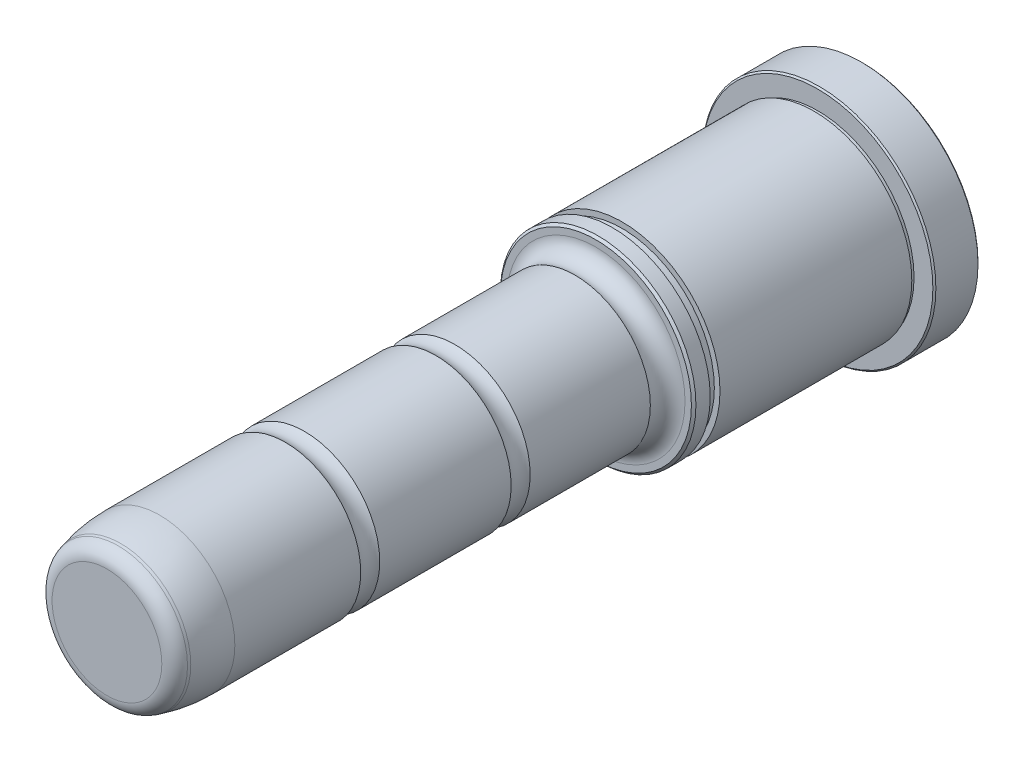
ISO-10303-21;
HEADER;
FILE_DESCRIPTION(('STEP AP214'),'2;1');
FILE_NAME('part.step','',(''),(''),'','','');
FILE_SCHEMA(('AUTOMOTIVE_DESIGN { 1 0 10303 214 1 1 1 1 }'));
ENDSEC;
DATA;
#1=APPLICATION_CONTEXT('core data for automotive mechanical design processes');
#2=APPLICATION_PROTOCOL_DEFINITION('international standard','automotive_design',2000,#1);
#3=PRODUCT_CONTEXT('',#1,'mechanical');
#4=PRODUCT('Part','Part','',(#3));
#5=PRODUCT_RELATED_PRODUCT_CATEGORY('part','',(#4));
#6=PRODUCT_DEFINITION_FORMATION('','',#4);
#7=PRODUCT_DEFINITION_CONTEXT('part definition',#1,'design');
#8=PRODUCT_DEFINITION('design','',#6,#7);
#9=PRODUCT_DEFINITION_SHAPE('','',#8);
#10=(LENGTH_UNIT() NAMED_UNIT(*) SI_UNIT(.MILLI.,.METRE.));
#11=(NAMED_UNIT(*) PLANE_ANGLE_UNIT() SI_UNIT($,.RADIAN.));
#12=(NAMED_UNIT(*) SI_UNIT($,.STERADIAN.) SOLID_ANGLE_UNIT());
#13=UNCERTAINTY_MEASURE_WITH_UNIT(LENGTH_MEASURE(1.E-05),#10,'distance_accuracy_value','');
#14=(GEOMETRIC_REPRESENTATION_CONTEXT(3) GLOBAL_UNCERTAINTY_ASSIGNED_CONTEXT((#13)) GLOBAL_UNIT_ASSIGNED_CONTEXT((#10,
#11,#12)) REPRESENTATION_CONTEXT('',''));
#15=CARTESIAN_POINT('',(0.,0.,0.));
#16=DIRECTION('',(0.,0.,1.));
#17=DIRECTION('',(1.,0.,0.));
#18=AXIS2_PLACEMENT_3D('',#15,#16,#17);
#19=CARTESIAN_POINT('',(0.,0.,0.250000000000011));
#20=DIRECTION('',(0.,0.,1.));
#21=DIRECTION('',(1.,0.,0.));
#22=AXIS2_PLACEMENT_3D('',#19,#20,#21);
#23=CYLINDRICAL_SURFACE('',#22,10.);
#24=CARTESIAN_POINT('',(0.,0.,38.5099342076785));
#25=DIRECTION('',(0.,0.,1.));
#26=DIRECTION('',(1.,0.,0.));
#27=AXIS2_PLACEMENT_3D('',#24,#25,#26);
#28=CIRCLE('',#27,10.);
#29=CARTESIAN_POINT('',(10.,0.,38.5099342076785));
#30=VERTEX_POINT('',#29);
#31=EDGE_CURVE('E10',#30,#30,#28,.T.);
#32=ORIENTED_EDGE('',*,*,#31,.T.);
#33=EDGE_LOOP('',(#32));
#34=FACE_BOUND('',#33,.T.);
#35=CARTESIAN_POINT('',(0.,0.,54.4850889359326));
#36=DIRECTION('',(0.,0.,1.));
#37=DIRECTION('',(1.,0.,0.));
#38=AXIS2_PLACEMENT_3D('',#35,#36,#37);
#39=CIRCLE('',#38,10.);
#40=CARTESIAN_POINT('',(10.,0.,54.4850889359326));
#41=VERTEX_POINT('',#40);
#42=EDGE_CURVE('E105',#41,#41,#39,.T.);
#43=ORIENTED_EDGE('',*,*,#42,.F.);
#44=EDGE_LOOP('',(#43));
#45=FACE_BOUND('',#44,.T.);
#46=ADVANCED_FACE('F34',(#34,#45),#23,.T.);
#47=CARTESIAN_POINT('',(0.,0.,0.250000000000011));
#48=DIRECTION('',(0.,0.,1.));
#49=DIRECTION('',(1.,0.,0.));
#50=AXIS2_PLACEMENT_3D('',#47,#48,#49);
#51=CYLINDRICAL_SURFACE('',#50,13.);
#52=CARTESIAN_POINT('',(0.,0.,35.45));
#53=DIRECTION('',(0.,0.,1.));
#54=DIRECTION('',(1.,0.,0.));
#55=AXIS2_PLACEMENT_3D('',#52,#53,#54);
#56=CIRCLE('',#55,13.);
#57=CARTESIAN_POINT('',(13.,0.,35.45));
#58=VERTEX_POINT('',#57);
#59=EDGE_CURVE('E78',#58,#58,#56,.T.);
#60=ORIENTED_EDGE('',*,*,#59,.F.);
#61=EDGE_LOOP('',(#60));
#62=FACE_BOUND('',#61,.T.);
#63=CARTESIAN_POINT('',(0.,0.,33.55));
#64=DIRECTION('',(0.,0.,1.));
#65=DIRECTION('',(1.,0.,0.));
#66=AXIS2_PLACEMENT_3D('',#63,#64,#65);
#67=CIRCLE('',#66,13.);
#68=CARTESIAN_POINT('',(13.,0.,33.55));
#69=VERTEX_POINT('',#68);
#70=EDGE_CURVE('E102',#69,#69,#67,.T.);
#71=ORIENTED_EDGE('',*,*,#70,.T.);
#72=EDGE_LOOP('',(#71));
#73=FACE_BOUND('',#72,.T.);
#74=ADVANCED_FACE('F130',(#62,#73),#51,.T.);
#75=CARTESIAN_POINT('',(0.,0.,37.75));
#76=DIRECTION('',(0.,0.,1.));
#77=DIRECTION('',(1.,0.,0.));
#78=AXIS2_PLACEMENT_3D('',#75,#76,#77);
#79=TOROIDAL_SURFACE('',#78,11.85,2.);
#80=ORIENTED_EDGE('',*,*,#31,.F.);
#81=EDGE_LOOP('',(#80));
#82=FACE_BOUND('',#81,.T.);
#83=CARTESIAN_POINT('',(0.,0.,35.75));
#84=DIRECTION('',(0.,0.,1.));
#85=DIRECTION('',(1.,0.,0.));
#86=AXIS2_PLACEMENT_3D('',#83,#84,#85);
#87=CIRCLE('',#86,11.85);
#88=CARTESIAN_POINT('',(11.85,0.,35.75));
#89=VERTEX_POINT('',#88);
#90=EDGE_CURVE('E84',#89,#89,#87,.T.);
#91=ORIENTED_EDGE('',*,*,#90,.T.);
#92=EDGE_LOOP('',(#91));
#93=FACE_BOUND('',#92,.T.);
#94=ADVANCED_FACE('F36',(#82,#93),#79,.F.);
#95=CARTESIAN_POINT('',(0.,0.,35.45));
#96=DIRECTION('',(0.,0.,-1.));
#97=DIRECTION('',(-1.,0.,0.));
#98=AXIS2_PLACEMENT_3D('',#95,#96,#97);
#99=CONICAL_SURFACE('',#98,13.,0.785398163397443);
#100=CARTESIAN_POINT('',(0.,0.,35.75));
#101=DIRECTION('',(0.,0.,1.));
#102=DIRECTION('',(1.,0.,0.));
#103=AXIS2_PLACEMENT_3D('',#100,#101,#102);
#104=CIRCLE('',#103,12.7);
#105=CARTESIAN_POINT('',(12.7,0.,35.75));
#106=VERTEX_POINT('',#105);
#107=EDGE_CURVE('E81',#106,#106,#104,.T.);
#108=ORIENTED_EDGE('',*,*,#107,.F.);
#109=EDGE_LOOP('',(#108));
#110=FACE_BOUND('',#109,.T.);
#111=ORIENTED_EDGE('',*,*,#59,.T.);
#112=EDGE_LOOP('',(#111));
#113=FACE_BOUND('',#112,.T.);
#114=ADVANCED_FACE('F164',(#110,#113),#99,.T.);
#115=CARTESIAN_POINT('',(0.,12.7,35.75));
#116=DIRECTION('',(0.,0.,-1.));
#117=DIRECTION('',(-1.,0.,0.));
#118=AXIS2_PLACEMENT_3D('',#115,#116,#117);
#119=PLANE('',#118);
#120=ORIENTED_EDGE('',*,*,#90,.F.);
#121=EDGE_LOOP('',(#120));
#122=FACE_BOUND('',#121,.T.);
#123=ORIENTED_EDGE('',*,*,#107,.T.);
#124=EDGE_LOOP('',(#123));
#125=FACE_BOUND('',#124,.T.);
#126=ADVANCED_FACE('F161',(#122,#125),#119,.F.);
#127=CARTESIAN_POINT('',(0.,13.,33.55));
#128=DIRECTION('',(0.,0.,-1.));
#129=DIRECTION('',(-1.,0.,0.));
#130=AXIS2_PLACEMENT_3D('',#127,#128,#129);
#131=PLANE('',#130);
#132=CARTESIAN_POINT('',(0.,0.,33.55));
#133=DIRECTION('',(0.,0.,1.));
#134=DIRECTION('',(1.,0.,0.));
#135=AXIS2_PLACEMENT_3D('',#132,#133,#134);
#136=CIRCLE('',#135,12.25);
#137=CARTESIAN_POINT('',(12.25,0.,33.55));
#138=VERTEX_POINT('',#137);
#139=EDGE_CURVE('E93',#138,#138,#136,.T.);
#140=ORIENTED_EDGE('',*,*,#139,.T.);
#141=EDGE_LOOP('',(#140));
#142=FACE_BOUND('',#141,.T.);
#143=ORIENTED_EDGE('',*,*,#70,.F.);
#144=EDGE_LOOP('',(#143));
#145=FACE_BOUND('',#144,.T.);
#146=ADVANCED_FACE('F159',(#142,#145),#131,.T.);
#147=CARTESIAN_POINT('',(0.,0.,100.75));
#148=DIRECTION('',(0.,0.,1.));
#149=DIRECTION('',(1.,0.,0.));
#150=AXIS2_PLACEMENT_3D('',#147,#148,#149);
#151=CYLINDRICAL_SURFACE('',#150,12.25);
#152=CARTESIAN_POINT('',(0.,0.,32.25));
#153=DIRECTION('',(0.,0.,1.));
#154=DIRECTION('',(1.,0.,0.));
#155=AXIS2_PLACEMENT_3D('',#152,#153,#154);
#156=CIRCLE('',#155,12.25);
#157=CARTESIAN_POINT('',(12.25,0.,32.25));
#158=VERTEX_POINT('',#157);
#159=EDGE_CURVE('E96',#158,#158,#156,.T.);
#160=ORIENTED_EDGE('',*,*,#159,.T.);
#161=EDGE_LOOP('',(#160));
#162=FACE_BOUND('',#161,.T.);
#163=ORIENTED_EDGE('',*,*,#139,.F.);
#164=EDGE_LOOP('',(#163));
#165=FACE_BOUND('',#164,.T.);
#166=ADVANCED_FACE('F237',(#162,#165),#151,.T.);
#167=CARTESIAN_POINT('',(0.,12.25,32.25));
#168=DIRECTION('',(0.,0.,1.));
#169=DIRECTION('',(1.,0.,0.));
#170=AXIS2_PLACEMENT_3D('',#167,#168,#169);
#171=PLANE('',#170);
#172=CARTESIAN_POINT('',(0.,0.,32.25));
#173=DIRECTION('',(0.,0.,1.));
#174=DIRECTION('',(1.,0.,0.));
#175=AXIS2_PLACEMENT_3D('',#172,#173,#174);
#176=CIRCLE('',#175,13.);
#177=CARTESIAN_POINT('',(13.,0.,32.25));
#178=VERTEX_POINT('',#177);
#179=EDGE_CURVE('E99',#178,#178,#176,.T.);
#180=ORIENTED_EDGE('',*,*,#179,.T.);
#181=EDGE_LOOP('',(#180));
#182=FACE_BOUND('',#181,.T.);
#183=ORIENTED_EDGE('',*,*,#159,.F.);
#184=EDGE_LOOP('',(#183));
#185=FACE_BOUND('',#184,.T.);
#186=ADVANCED_FACE('F194',(#182,#185),#171,.T.);
#187=CARTESIAN_POINT('',(0.,0.,0.250000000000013));
#188=DIRECTION('',(0.,0.,1.));
#189=DIRECTION('',(1.,0.,0.));
#190=AXIS2_PLACEMENT_3D('',#187,#188,#189);
#191=PLANE('',#190);
#192=CARTESIAN_POINT('',(0.,0.,0.250000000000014));
#193=DIRECTION('',(0.,0.,1.));
#194=DIRECTION('',(1.,0.,0.));
#195=AXIS2_PLACEMENT_3D('',#192,#193,#194);
#196=CIRCLE('',#195,15.3);
#197=CARTESIAN_POINT('',(15.3,0.,0.250000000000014));
#198=VERTEX_POINT('',#197);
#199=EDGE_CURVE('E57',#198,#198,#196,.T.);
#200=ORIENTED_EDGE('',*,*,#199,.F.);
#201=EDGE_LOOP('',(#200));
#202=FACE_BOUND('',#201,.T.);
#203=ADVANCED_FACE('F191',(#202),#191,.F.);
#204=CARTESIAN_POINT('',(0.,0.,0.250000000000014));
#205=DIRECTION('',(0.,0.,1.));
#206=DIRECTION('',(1.,0.,0.));
#207=AXIS2_PLACEMENT_3D('',#204,#205,#206);
#208=CONICAL_SURFACE('',#207,15.3,0.785398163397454);
#209=CARTESIAN_POINT('',(0.,0.,0.450000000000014));
#210=DIRECTION('',(0.,0.,1.));
#211=DIRECTION('',(1.,0.,0.));
#212=AXIS2_PLACEMENT_3D('',#209,#210,#211);
#213=CIRCLE('',#212,15.5);
#214=CARTESIAN_POINT('',(15.5,0.,0.450000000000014));
#215=VERTEX_POINT('',#214);
#216=EDGE_CURVE('E60',#215,#215,#213,.T.);
#217=ORIENTED_EDGE('',*,*,#216,.F.);
#218=EDGE_LOOP('',(#217));
#219=FACE_BOUND('',#218,.T.);
#220=ORIENTED_EDGE('',*,*,#199,.T.);
#221=EDGE_LOOP('',(#220));
#222=FACE_BOUND('',#221,.T.);
#223=ADVANCED_FACE('F187',(#219,#222),#208,.T.);
#224=CARTESIAN_POINT('',(0.,0.,0.250000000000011));
#225=DIRECTION('',(0.,0.,1.));
#226=DIRECTION('',(1.,0.,0.));
#227=AXIS2_PLACEMENT_3D('',#224,#225,#226);
#228=CYLINDRICAL_SURFACE('',#227,15.5);
#229=CARTESIAN_POINT('',(0.,0.,6.05000000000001));
#230=DIRECTION('',(0.,0.,1.));
#231=DIRECTION('',(1.,0.,0.));
#232=AXIS2_PLACEMENT_3D('',#229,#230,#231);
#233=CIRCLE('',#232,15.5);
#234=CARTESIAN_POINT('',(15.5,0.,6.05000000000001));
#235=VERTEX_POINT('',#234);
#236=EDGE_CURVE('E63',#235,#235,#233,.T.);
#237=ORIENTED_EDGE('',*,*,#236,.F.);
#238=EDGE_LOOP('',(#237));
#239=FACE_BOUND('',#238,.T.);
#240=ORIENTED_EDGE('',*,*,#216,.T.);
#241=EDGE_LOOP('',(#240));
#242=FACE_BOUND('',#241,.T.);
#243=ADVANCED_FACE('F183',(#239,#242),#228,.T.);
#244=CARTESIAN_POINT('',(0.,0.,6.05000000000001));
#245=DIRECTION('',(0.,0.,-1.));
#246=DIRECTION('',(-1.,0.,0.));
#247=AXIS2_PLACEMENT_3D('',#244,#245,#246);
#248=CONICAL_SURFACE('',#247,15.5,0.785398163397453);
#249=CARTESIAN_POINT('',(0.,0.,6.25000000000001));
#250=DIRECTION('',(0.,0.,1.));
#251=DIRECTION('',(1.,0.,0.));
#252=AXIS2_PLACEMENT_3D('',#249,#250,#251);
#253=CIRCLE('',#252,15.3);
#254=CARTESIAN_POINT('',(15.3,0.,6.25000000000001));
#255=VERTEX_POINT('',#254);
#256=EDGE_CURVE('E66',#255,#255,#253,.T.);
#257=ORIENTED_EDGE('',*,*,#256,.F.);
#258=EDGE_LOOP('',(#257));
#259=FACE_BOUND('',#258,.T.);
#260=ORIENTED_EDGE('',*,*,#236,.T.);
#261=EDGE_LOOP('',(#260));
#262=FACE_BOUND('',#261,.T.);
#263=ADVANCED_FACE('F179',(#259,#262),#248,.T.);
#264=CARTESIAN_POINT('',(0.,15.3,6.25000000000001));
#265=DIRECTION('',(0.,0.,-1.));
#266=DIRECTION('',(-1.,0.,0.));
#267=AXIS2_PLACEMENT_3D('',#264,#265,#266);
#268=PLANE('',#267);
#269=CARTESIAN_POINT('',(0.,0.,6.25000000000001));
#270=DIRECTION('',(0.,0.,1.));
#271=DIRECTION('',(1.,0.,0.));
#272=AXIS2_PLACEMENT_3D('',#269,#270,#271);
#273=CIRCLE('',#272,12.8);
#274=CARTESIAN_POINT('',(12.8,0.,6.25000000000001));
#275=VERTEX_POINT('',#274);
#276=EDGE_CURVE('E69',#275,#275,#273,.T.);
#277=ORIENTED_EDGE('',*,*,#276,.F.);
#278=EDGE_LOOP('',(#277));
#279=FACE_BOUND('',#278,.T.);
#280=ORIENTED_EDGE('',*,*,#256,.T.);
#281=EDGE_LOOP('',(#280));
#282=FACE_BOUND('',#281,.T.);
#283=ADVANCED_FACE('F175',(#279,#282),#268,.F.);
#284=CARTESIAN_POINT('',(0.,0.,0.250000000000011));
#285=DIRECTION('',(0.,0.,1.));
#286=DIRECTION('',(1.,0.,0.));
#287=AXIS2_PLACEMENT_3D('',#284,#285,#286);
#288=CYLINDRICAL_SURFACE('',#287,12.8);
#289=CARTESIAN_POINT('',(0.,0.,6.75000000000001));
#290=DIRECTION('',(0.,0.,1.));
#291=DIRECTION('',(1.,0.,0.));
#292=AXIS2_PLACEMENT_3D('',#289,#290,#291);
#293=CIRCLE('',#292,12.8);
#294=CARTESIAN_POINT('',(12.8,0.,6.75000000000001));
#295=VERTEX_POINT('',#294);
#296=EDGE_CURVE('E72',#295,#295,#293,.T.);
#297=ORIENTED_EDGE('',*,*,#296,.F.);
#298=EDGE_LOOP('',(#297));
#299=FACE_BOUND('',#298,.T.);
#300=ORIENTED_EDGE('',*,*,#276,.T.);
#301=EDGE_LOOP('',(#300));
#302=FACE_BOUND('',#301,.T.);
#303=ADVANCED_FACE('F171',(#299,#302),#288,.T.);
#304=CARTESIAN_POINT('',(0.,12.8,6.75000000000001));
#305=DIRECTION('',(0.,0.,1.));
#306=DIRECTION('',(1.,0.,0.));
#307=AXIS2_PLACEMENT_3D('',#304,#305,#306);
#308=PLANE('',#307);
#309=CARTESIAN_POINT('',(0.,0.,6.75000000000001));
#310=DIRECTION('',(0.,0.,1.));
#311=DIRECTION('',(1.,0.,0.));
#312=AXIS2_PLACEMENT_3D('',#309,#310,#311);
#313=CIRCLE('',#312,13.);
#314=CARTESIAN_POINT('',(13.,0.,6.75000000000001));
#315=VERTEX_POINT('',#314);
#316=EDGE_CURVE('E75',#315,#315,#313,.T.);
#317=ORIENTED_EDGE('',*,*,#316,.F.);
#318=EDGE_LOOP('',(#317));
#319=FACE_BOUND('',#318,.T.);
#320=ORIENTED_EDGE('',*,*,#296,.T.);
#321=EDGE_LOOP('',(#320));
#322=FACE_BOUND('',#321,.T.);
#323=ADVANCED_FACE('F127',(#319,#322),#308,.F.);
#324=ORIENTED_EDGE('',*,*,#316,.T.);
#325=EDGE_LOOP('',(#324));
#326=FACE_BOUND('',#325,.T.);
#327=ORIENTED_EDGE('',*,*,#179,.F.);
#328=EDGE_LOOP('',(#327));
#329=FACE_BOUND('',#328,.T.);
#330=ADVANCED_FACE('F117',(#326,#329),#51,.T.);
#331=CARTESIAN_POINT('',(0.,0.,55.75));
#332=DIRECTION('',(0.,0.,1.));
#333=DIRECTION('',(1.,0.,0.));
#334=AXIS2_PLACEMENT_3D('',#331,#332,#333);
#335=TOROIDAL_SURFACE('',#334,11.8000000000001,2.20000000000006);
#336=ORIENTED_EDGE('',*,*,#42,.T.);
#337=EDGE_LOOP('',(#336));
#338=FACE_BOUND('',#337,.T.);
#339=CARTESIAN_POINT('',(0.,0.,57.0149110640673));
#340=DIRECTION('',(0.,0.,1.));
#341=DIRECTION('',(1.,0.,0.));
#342=AXIS2_PLACEMENT_3D('',#339,#340,#341);
#343=CIRCLE('',#342,10.);
#344=CARTESIAN_POINT('',(10.,0.,57.0149110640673));
#345=VERTEX_POINT('',#344);
#346=EDGE_CURVE('E108',#345,#345,#343,.T.);
#347=ORIENTED_EDGE('',*,*,#346,.F.);
#348=EDGE_LOOP('',(#347));
#349=FACE_BOUND('',#348,.T.);
#350=ADVANCED_FACE('F114',(#338,#349),#335,.F.);
#351=CARTESIAN_POINT('',(0.,7.29522528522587,100.75));
#352=DIRECTION('',(0.,0.,-1.));
#353=DIRECTION('',(-1.,0.,0.));
#354=AXIS2_PLACEMENT_3D('',#351,#352,#353);
#355=PLANE('',#354);
#356=CARTESIAN_POINT('',(0.,0.,100.75));
#357=DIRECTION('',(0.,0.,1.));
#358=DIRECTION('',(1.,0.,0.));
#359=AXIS2_PLACEMENT_3D('',#356,#357,#358);
#360=CIRCLE('',#359,7.29522528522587);
#361=CARTESIAN_POINT('',(7.29522528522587,0.,100.75));
#362=VERTEX_POINT('',#361);
#363=EDGE_CURVE('E54',#362,#362,#360,.T.);
#364=ORIENTED_EDGE('',*,*,#363,.T.);
#365=EDGE_LOOP('',(#364));
#366=FACE_BOUND('',#365,.T.);
#367=ADVANCED_FACE('F116',(#366),#355,.F.);
#368=CARTESIAN_POINT('',(0.,0.,98.75));
#369=DIRECTION('',(0.,0.,1.));
#370=DIRECTION('',(1.,0.,0.));
#371=AXIS2_PLACEMENT_3D('',#368,#369,#370);
#372=TOROIDAL_SURFACE('',#371,7.29522528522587,1.99999999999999);
#373=ORIENTED_EDGE('',*,*,#363,.F.);
#374=EDGE_LOOP('',(#373));
#375=FACE_BOUND('',#374,.T.);
#376=CARTESIAN_POINT('',(0.,0.,99.267638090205));
#377=DIRECTION('',(0.,0.,1.));
#378=DIRECTION('',(1.,0.,0.));
#379=AXIS2_PLACEMENT_3D('',#376,#377,#378);
#380=CIRCLE('',#379,9.22707693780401);
#381=CARTESIAN_POINT('',(9.22707693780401,0.,99.267638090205));
#382=VERTEX_POINT('',#381);
#383=EDGE_CURVE('E49',#382,#382,#380,.T.);
#384=ORIENTED_EDGE('',*,*,#383,.T.);
#385=EDGE_LOOP('',(#384));
#386=FACE_BOUND('',#385,.T.);
#387=ADVANCED_FACE('F124',(#375,#386),#372,.T.);
#388=CARTESIAN_POINT('',(0.,0.,98.9263809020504));
#389=DIRECTION('',(0.,0.,-1.));
#390=DIRECTION('',(-1.,0.,0.));
#391=AXIS2_PLACEMENT_3D('',#388,#389,#390);
#392=CONICAL_SURFACE('',#391,9.31851652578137,0.261799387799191);
#393=ORIENTED_EDGE('',*,*,#383,.F.);
#394=EDGE_LOOP('',(#393));
#395=FACE_BOUND('',#394,.T.);
#396=CARTESIAN_POINT('',(0.,0.,98.9263809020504));
#397=DIRECTION('',(0.,0.,1.));
#398=DIRECTION('',(1.,0.,0.));
#399=AXIS2_PLACEMENT_3D('',#396,#397,#398);
#400=CIRCLE('',#399,9.31851652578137);
#401=CARTESIAN_POINT('',(9.31851652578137,0.,98.9263809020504));
#402=VERTEX_POINT('',#401);
#403=EDGE_CURVE('E45',#402,#402,#400,.T.);
#404=ORIENTED_EDGE('',*,*,#403,.T.);
#405=EDGE_LOOP('',(#404));
#406=FACE_BOUND('',#405,.T.);
#407=ADVANCED_FACE('F199',(#395,#406),#392,.T.);
#408=CARTESIAN_POINT('',(0.,0.,93.75));
#409=DIRECTION('',(0.,0.,1.));
#410=DIRECTION('',(1.,0.,0.));
#411=AXIS2_PLACEMENT_3D('',#408,#409,#410);
#412=DEGENERATE_TOROIDAL_SURFACE('',#411,10.,20.,.F.);
#413=ORIENTED_EDGE('',*,*,#403,.F.);
#414=EDGE_LOOP('',(#413));
#415=FACE_BOUND('',#414,.T.);
#416=CARTESIAN_POINT('',(0.,0.,93.75));
#417=DIRECTION('',(0.,0.,1.));
#418=DIRECTION('',(1.,0.,0.));
#419=AXIS2_PLACEMENT_3D('',#416,#417,#418);
#420=CIRCLE('',#419,10.);
#421=CARTESIAN_POINT('',(10.,0.,93.75));
#422=VERTEX_POINT('',#421);
#423=EDGE_CURVE('E41',#422,#422,#420,.T.);
#424=ORIENTED_EDGE('',*,*,#423,.T.);
#425=EDGE_LOOP('',(#424));
#426=FACE_BOUND('',#425,.T.);
#427=ADVANCED_FACE('F142',(#415,#426),#412,.F.);
#428=ORIENTED_EDGE('',*,*,#423,.F.);
#429=EDGE_LOOP('',(#428));
#430=FACE_BOUND('',#429,.T.);
#431=CARTESIAN_POINT('',(0.,0.,77.0149110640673));
#432=DIRECTION('',(0.,0.,1.));
#433=DIRECTION('',(1.,0.,0.));
#434=AXIS2_PLACEMENT_3D('',#431,#432,#433);
#435=CIRCLE('',#434,10.);
#436=CARTESIAN_POINT('',(10.,0.,77.0149110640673));
#437=VERTEX_POINT('',#436);
#438=EDGE_CURVE('E90',#437,#437,#435,.T.);
#439=ORIENTED_EDGE('',*,*,#438,.T.);
#440=EDGE_LOOP('',(#439));
#441=FACE_BOUND('',#440,.T.);
#442=ADVANCED_FACE('F133',(#430,#441),#23,.T.);
#443=CARTESIAN_POINT('',(0.,0.,75.75));
#444=DIRECTION('',(0.,0.,1.));
#445=DIRECTION('',(1.,0.,0.));
#446=AXIS2_PLACEMENT_3D('',#443,#444,#445);
#447=TOROIDAL_SURFACE('',#446,11.8000000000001,2.20000000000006);
#448=CARTESIAN_POINT('',(0.,0.,74.4850889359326));
#449=DIRECTION('',(0.,0.,1.));
#450=DIRECTION('',(1.,0.,0.));
#451=AXIS2_PLACEMENT_3D('',#448,#449,#450);
#452=CIRCLE('',#451,10.);
#453=CARTESIAN_POINT('',(10.,0.,74.4850889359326));
#454=VERTEX_POINT('',#453);
#455=EDGE_CURVE('E87',#454,#454,#452,.T.);
#456=ORIENTED_EDGE('',*,*,#455,.T.);
#457=EDGE_LOOP('',(#456));
#458=FACE_BOUND('',#457,.T.);
#459=ORIENTED_EDGE('',*,*,#438,.F.);
#460=EDGE_LOOP('',(#459));
#461=FACE_BOUND('',#460,.T.);
#462=ADVANCED_FACE('F141',(#458,#461),#447,.F.);
#463=ORIENTED_EDGE('',*,*,#455,.F.);
#464=EDGE_LOOP('',(#463));
#465=FACE_BOUND('',#464,.T.);
#466=ORIENTED_EDGE('',*,*,#346,.T.);
#467=EDGE_LOOP('',(#466));
#468=FACE_BOUND('',#467,.T.);
#469=ADVANCED_FACE('F112',(#465,#468),#23,.T.);
#470=CLOSED_SHELL('',(#46,#74,#94,#114,#126,#146,#166,#186,#203,#223,#243,#263,#283,#303,#323,
#330,#350,#367,#387,#407,#427,#442,#462,#469));
#471=MANIFOLD_SOLID_BREP('B2',#470);
#472=ADVANCED_BREP_SHAPE_REPRESENTATION('',(#18,#471),#14);
#473=SHAPE_DEFINITION_REPRESENTATION(#9,#472);
ENDSEC;
END-ISO-10303-21;
